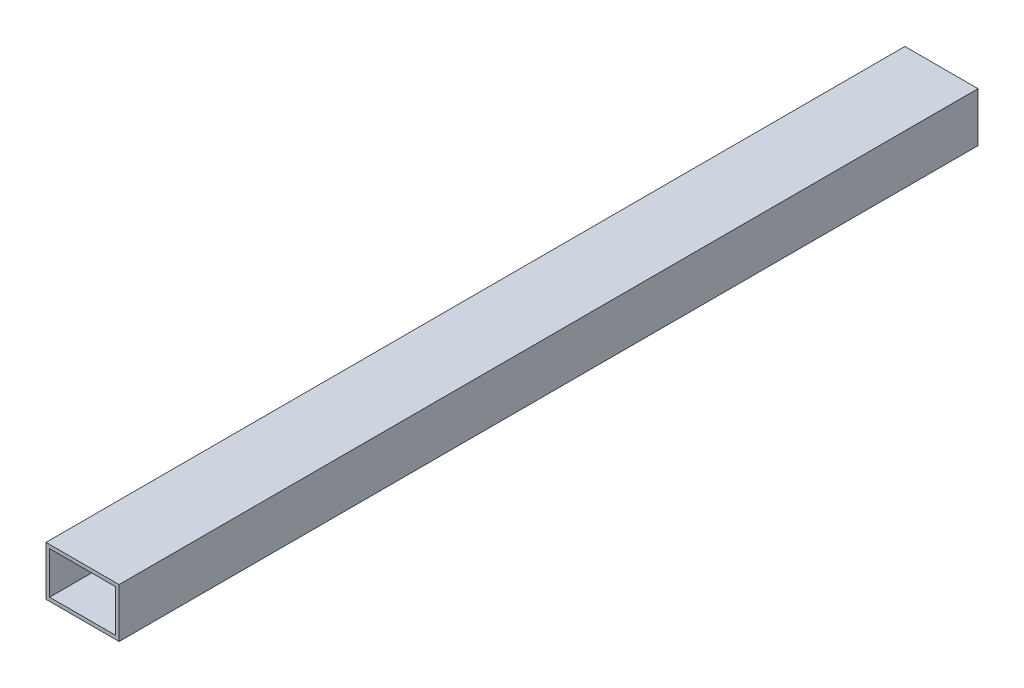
from build123d import *

# Parameters (mm, degrees)
ESQUISSE1_W      = 40
ESQUISSE1_H      = 27
ESQUISSE1_W_2    = 36
ESQUISSE1_H_2    = 23
EXTRUSION1_DEPTH = 470


with BuildPart() as part:
    # Esquisse1 → Extrusion1 (new body)
    with BuildSketch(Plane.XY):
        with Locations((18, 11.5)):
            Rectangle(ESQUISSE1_W, ESQUISSE1_H)
        with Locations((18, 11.5)):
            Rectangle(ESQUISSE1_W_2, ESQUISSE1_H_2, mode=Mode.SUBTRACT)
    extrude(amount=EXTRUSION1_DEPTH)


solid = part.part
